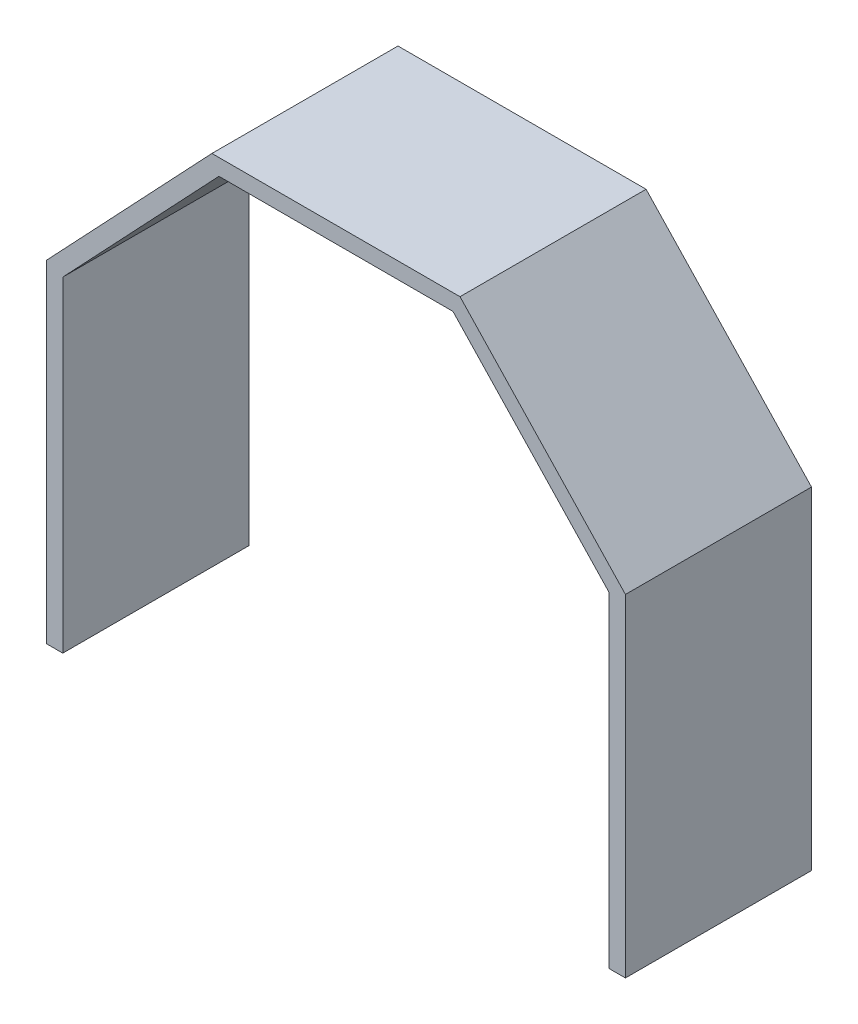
ISO-10303-21;
HEADER;
FILE_DESCRIPTION(('STEP AP214'),'2;1');
FILE_NAME('part.step','',(''),(''),'','','');
FILE_SCHEMA(('AUTOMOTIVE_DESIGN { 1 0 10303 214 1 1 1 1 }'));
ENDSEC;
DATA;
#1=APPLICATION_CONTEXT('core data for automotive mechanical design processes');
#2=APPLICATION_PROTOCOL_DEFINITION('international standard','automotive_design',2000,#1);
#3=PRODUCT_CONTEXT('',#1,'mechanical');
#4=PRODUCT('Part','Part','',(#3));
#5=PRODUCT_RELATED_PRODUCT_CATEGORY('part','',(#4));
#6=PRODUCT_DEFINITION_FORMATION('','',#4);
#7=PRODUCT_DEFINITION_CONTEXT('part definition',#1,'design');
#8=PRODUCT_DEFINITION('design','',#6,#7);
#9=PRODUCT_DEFINITION_SHAPE('','',#8);
#10=(LENGTH_UNIT() NAMED_UNIT(*) SI_UNIT(.MILLI.,.METRE.));
#11=(NAMED_UNIT(*) PLANE_ANGLE_UNIT() SI_UNIT($,.RADIAN.));
#12=(NAMED_UNIT(*) SI_UNIT($,.STERADIAN.) SOLID_ANGLE_UNIT());
#13=UNCERTAINTY_MEASURE_WITH_UNIT(LENGTH_MEASURE(1.E-05),#10,'distance_accuracy_value','');
#14=(GEOMETRIC_REPRESENTATION_CONTEXT(3) GLOBAL_UNCERTAINTY_ASSIGNED_CONTEXT((#13)) GLOBAL_UNIT_ASSIGNED_CONTEXT((#10,
#11,#12)) REPRESENTATION_CONTEXT('',''));
#15=CARTESIAN_POINT('',(0.,0.,0.));
#16=DIRECTION('',(0.,0.,1.));
#17=DIRECTION('',(1.,0.,0.));
#18=AXIS2_PLACEMENT_3D('',#15,#16,#17);
#19=CARTESIAN_POINT('',(35.56,15.24,22.86));
#20=DIRECTION('',(-1.,0.,0.));
#21=DIRECTION('',(0.,0.,1.));
#22=AXIS2_PLACEMENT_3D('',#19,#20,#21);
#23=PLANE('',#22);
#24=DIRECTION('',(0.,1.,0.));
#25=VECTOR('',#24,1.);
#26=CARTESIAN_POINT('',(35.56,15.24,0.));
#27=LINE('',#26,#25);
#28=CARTESIAN_POINT('',(35.56,-25.5651,0.));
#29=VERTEX_POINT('',#28);
#30=CARTESIAN_POINT('',(35.56,15.24,0.));
#31=VERTEX_POINT('',#30);
#32=EDGE_CURVE('E97',#29,#31,#27,.T.);
#33=ORIENTED_EDGE('',*,*,#32,.T.);
#34=DIRECTION('',(0.,0.,-1.));
#35=VECTOR('',#34,1.);
#36=CARTESIAN_POINT('',(35.56,15.24,22.86));
#37=LINE('',#36,#35);
#38=CARTESIAN_POINT('',(35.56,15.24,22.86));
#39=VERTEX_POINT('',#38);
#40=EDGE_CURVE('E11',#39,#31,#37,.T.);
#41=ORIENTED_EDGE('',*,*,#40,.F.);
#42=DIRECTION('',(0.,1.,0.));
#43=VECTOR('',#42,1.);
#44=CARTESIAN_POINT('',(35.56,-15.24,22.86));
#45=LINE('',#44,#43);
#46=CARTESIAN_POINT('',(35.56,-25.5651,22.86));
#47=VERTEX_POINT('',#46);
#48=EDGE_CURVE('E103',#47,#39,#45,.T.);
#49=ORIENTED_EDGE('',*,*,#48,.F.);
#50=DIRECTION('',(0.,0.,-1.));
#51=VECTOR('',#50,1.);
#52=CARTESIAN_POINT('',(35.56,-25.5651,22.86));
#53=LINE('',#52,#51);
#54=EDGE_CURVE('E149',#47,#29,#53,.T.);
#55=ORIENTED_EDGE('',*,*,#54,.T.);
#56=EDGE_LOOP('',(#33,#41,#49,#55));
#57=FACE_BOUND('',#56,.T.);
#58=ADVANCED_FACE('F33',(#57),#23,.F.);
#59=CARTESIAN_POINT('',(15.24,36.7600000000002,22.86));
#60=DIRECTION('',(-0.727088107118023,-0.686544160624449,0.));
#61=DIRECTION('',(0.686544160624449,-0.727088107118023,0.));
#62=AXIS2_PLACEMENT_3D('',#59,#60,#61);
#63=PLANE('',#62);
#64=DIRECTION('',(-0.686544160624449,0.727088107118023,0.));
#65=VECTOR('',#64,1.);
#66=CARTESIAN_POINT('',(15.24,36.7600000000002,0.));
#67=LINE('',#66,#65);
#68=CARTESIAN_POINT('',(15.24,36.7600000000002,0.));
#69=VERTEX_POINT('',#68);
#70=EDGE_CURVE('E154',#31,#69,#67,.T.);
#71=ORIENTED_EDGE('',*,*,#70,.T.);
#72=DIRECTION('',(0.,0.,-1.));
#73=VECTOR('',#72,1.);
#74=CARTESIAN_POINT('',(15.24,36.7600000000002,22.86));
#75=LINE('',#74,#73);
#76=CARTESIAN_POINT('',(15.24,36.7600000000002,22.86));
#77=VERTEX_POINT('',#76);
#78=EDGE_CURVE('E41',#77,#69,#75,.T.);
#79=ORIENTED_EDGE('',*,*,#78,.F.);
#80=DIRECTION('',(-0.686544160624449,0.727088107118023,0.));
#81=VECTOR('',#80,1.);
#82=CARTESIAN_POINT('',(15.24,36.7600000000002,22.86));
#83=LINE('',#82,#81);
#84=EDGE_CURVE('E242',#39,#77,#83,.T.);
#85=ORIENTED_EDGE('',*,*,#84,.F.);
#86=ORIENTED_EDGE('',*,*,#40,.T.);
#87=EDGE_LOOP('',(#71,#79,#85,#86));
#88=FACE_BOUND('',#87,.T.);
#89=ADVANCED_FACE('F245',(#88),#63,.F.);
#90=CARTESIAN_POINT('',(-15.24,36.76,22.86));
#91=DIRECTION('',(0.,-1.,0.));
#92=DIRECTION('',(1.,0.,0.));
#93=AXIS2_PLACEMENT_3D('',#90,#91,#92);
#94=PLANE('',#93);
#95=DIRECTION('',(-1.,0.,0.));
#96=VECTOR('',#95,1.);
#97=CARTESIAN_POINT('',(-15.24,36.76,0.));
#98=LINE('',#97,#96);
#99=CARTESIAN_POINT('',(-15.24,36.76,0.));
#100=VERTEX_POINT('',#99);
#101=EDGE_CURVE('E156',#69,#100,#98,.T.);
#102=ORIENTED_EDGE('',*,*,#101,.T.);
#103=DIRECTION('',(0.,0.,-1.));
#104=VECTOR('',#103,1.);
#105=CARTESIAN_POINT('',(-15.24,36.76,22.86));
#106=LINE('',#105,#104);
#107=CARTESIAN_POINT('',(-15.24,36.76,22.86));
#108=VERTEX_POINT('',#107);
#109=EDGE_CURVE('E195',#108,#100,#106,.T.);
#110=ORIENTED_EDGE('',*,*,#109,.F.);
#111=DIRECTION('',(-1.,0.,0.));
#112=VECTOR('',#111,1.);
#113=CARTESIAN_POINT('',(-15.24,36.76,22.86));
#114=LINE('',#113,#112);
#115=EDGE_CURVE('E204',#77,#108,#114,.T.);
#116=ORIENTED_EDGE('',*,*,#115,.F.);
#117=ORIENTED_EDGE('',*,*,#78,.T.);
#118=EDGE_LOOP('',(#102,#110,#116,#117));
#119=FACE_BOUND('',#118,.T.);
#120=ADVANCED_FACE('F202',(#119),#94,.F.);
#121=CARTESIAN_POINT('',(-35.56,15.24,22.86));
#122=DIRECTION('',(0.727088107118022,-0.68654416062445,0.));
#123=DIRECTION('',(0.686544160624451,0.727088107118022,0.));
#124=AXIS2_PLACEMENT_3D('',#121,#122,#123);
#125=PLANE('',#124);
#126=DIRECTION('',(-0.68654416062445,-0.727088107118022,0.));
#127=VECTOR('',#126,1.);
#128=CARTESIAN_POINT('',(-35.56,15.24,0.));
#129=LINE('',#128,#127);
#130=CARTESIAN_POINT('',(-35.56,15.24,0.));
#131=VERTEX_POINT('',#130);
#132=EDGE_CURVE('E158',#100,#131,#129,.T.);
#133=ORIENTED_EDGE('',*,*,#132,.T.);
#134=DIRECTION('',(0.,0.,-1.));
#135=VECTOR('',#134,1.);
#136=CARTESIAN_POINT('',(-35.56,15.24,22.86));
#137=LINE('',#136,#135);
#138=CARTESIAN_POINT('',(-35.56,15.24,22.86));
#139=VERTEX_POINT('',#138);
#140=EDGE_CURVE('E192',#139,#131,#137,.T.);
#141=ORIENTED_EDGE('',*,*,#140,.F.);
#142=DIRECTION('',(-0.68654416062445,-0.727088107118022,0.));
#143=VECTOR('',#142,1.);
#144=CARTESIAN_POINT('',(-35.56,15.24,22.86));
#145=LINE('',#144,#143);
#146=EDGE_CURVE('E221',#108,#139,#145,.T.);
#147=ORIENTED_EDGE('',*,*,#146,.F.);
#148=ORIENTED_EDGE('',*,*,#109,.T.);
#149=EDGE_LOOP('',(#133,#141,#147,#148));
#150=FACE_BOUND('',#149,.T.);
#151=ADVANCED_FACE('F212',(#150),#125,.F.);
#152=CARTESIAN_POINT('',(-35.56,-15.24,22.86));
#153=DIRECTION('',(1.,0.,0.));
#154=DIRECTION('',(0.,1.,0.));
#155=AXIS2_PLACEMENT_3D('',#152,#153,#154);
#156=PLANE('',#155);
#157=DIRECTION('',(0.,-1.,0.));
#158=VECTOR('',#157,1.);
#159=CARTESIAN_POINT('',(-35.56,-15.24,0.));
#160=LINE('',#159,#158);
#161=CARTESIAN_POINT('',(-35.56,-25.5651,0.));
#162=VERTEX_POINT('',#161);
#163=EDGE_CURVE('E161',#131,#162,#160,.T.);
#164=ORIENTED_EDGE('',*,*,#163,.T.);
#165=DIRECTION('',(0.,0.,-1.));
#166=VECTOR('',#165,1.);
#167=CARTESIAN_POINT('',(-35.56,-25.5651,22.86));
#168=LINE('',#167,#166);
#169=CARTESIAN_POINT('',(-35.56,-25.5651,22.86));
#170=VERTEX_POINT('',#169);
#171=EDGE_CURVE('E189',#170,#162,#168,.T.);
#172=ORIENTED_EDGE('',*,*,#171,.F.);
#173=DIRECTION('',(0.,-1.,0.));
#174=VECTOR('',#173,1.);
#175=CARTESIAN_POINT('',(-35.56,15.24,22.86));
#176=LINE('',#175,#174);
#177=EDGE_CURVE('E218',#139,#170,#176,.T.);
#178=ORIENTED_EDGE('',*,*,#177,.F.);
#179=ORIENTED_EDGE('',*,*,#140,.T.);
#180=EDGE_LOOP('',(#164,#172,#178,#179));
#181=FACE_BOUND('',#180,.T.);
#182=ADVANCED_FACE('F216',(#181),#156,.F.);
#183=CARTESIAN_POINT('',(-35.56,-25.5651,22.86));
#184=DIRECTION('',(0.,1.,0.));
#185=DIRECTION('',(0.,0.,1.));
#186=AXIS2_PLACEMENT_3D('',#183,#184,#185);
#187=PLANE('',#186);
#188=DIRECTION('',(1.,0.,0.));
#189=VECTOR('',#188,1.);
#190=CARTESIAN_POINT('',(-35.56,-25.5651,0.));
#191=LINE('',#190,#189);
#192=CARTESIAN_POINT('',(-33.56,-25.5651,0.));
#193=VERTEX_POINT('',#192);
#194=EDGE_CURVE('E163',#162,#193,#191,.T.);
#195=ORIENTED_EDGE('',*,*,#194,.T.);
#196=DIRECTION('',(0.,0.,-1.));
#197=VECTOR('',#196,1.);
#198=CARTESIAN_POINT('',(-33.56,-25.5651,22.86));
#199=LINE('',#198,#197);
#200=CARTESIAN_POINT('',(-33.56,-25.5651,22.86));
#201=VERTEX_POINT('',#200);
#202=EDGE_CURVE('E186',#201,#193,#199,.T.);
#203=ORIENTED_EDGE('',*,*,#202,.F.);
#204=DIRECTION('',(1.,0.,0.));
#205=VECTOR('',#204,1.);
#206=CARTESIAN_POINT('',(-35.56,-25.5651,22.86));
#207=LINE('',#206,#205);
#208=EDGE_CURVE('E220',#170,#201,#207,.T.);
#209=ORIENTED_EDGE('',*,*,#208,.F.);
#210=ORIENTED_EDGE('',*,*,#171,.T.);
#211=EDGE_LOOP('',(#195,#203,#209,#210));
#212=FACE_BOUND('',#211,.T.);
#213=ADVANCED_FACE('F257',(#212),#187,.F.);
#214=CARTESIAN_POINT('',(-33.56,-25.5651,22.86));
#215=DIRECTION('',(-1.,0.,0.));
#216=DIRECTION('',(0.,-1.,0.));
#217=AXIS2_PLACEMENT_3D('',#214,#215,#216);
#218=PLANE('',#217);
#219=DIRECTION('',(0.,1.,0.));
#220=VECTOR('',#219,1.);
#221=CARTESIAN_POINT('',(-33.56,-25.5651,0.));
#222=LINE('',#221,#220);
#223=CARTESIAN_POINT('',(-33.56,14.4449691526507,0.));
#224=VERTEX_POINT('',#223);
#225=EDGE_CURVE('E165',#193,#224,#222,.T.);
#226=ORIENTED_EDGE('',*,*,#225,.T.);
#227=DIRECTION('',(0.,0.,-1.));
#228=VECTOR('',#227,1.);
#229=CARTESIAN_POINT('',(-33.56,14.4449691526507,22.86));
#230=LINE('',#229,#228);
#231=CARTESIAN_POINT('',(-33.56,14.4449691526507,22.86));
#232=VERTEX_POINT('',#231);
#233=EDGE_CURVE('E183',#232,#224,#230,.T.);
#234=ORIENTED_EDGE('',*,*,#233,.F.);
#235=DIRECTION('',(0.,1.,0.));
#236=VECTOR('',#235,1.);
#237=CARTESIAN_POINT('',(-33.56,-25.5651,22.86));
#238=LINE('',#237,#236);
#239=EDGE_CURVE('E223',#201,#232,#238,.T.);
#240=ORIENTED_EDGE('',*,*,#239,.F.);
#241=ORIENTED_EDGE('',*,*,#202,.T.);
#242=EDGE_LOOP('',(#226,#234,#240,#241));
#243=FACE_BOUND('',#242,.T.);
#244=ADVANCED_FACE('F260',(#243),#218,.F.);
#245=CARTESIAN_POINT('',(-33.56,14.4449691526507,22.86));
#246=DIRECTION('',(-0.727088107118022,0.686544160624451,0.));
#247=DIRECTION('',(-0.686544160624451,-0.727088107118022,0.));
#248=AXIS2_PLACEMENT_3D('',#245,#246,#247);
#249=PLANE('',#248);
#250=DIRECTION('',(0.686544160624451,0.727088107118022,0.));
#251=VECTOR('',#250,1.);
#252=CARTESIAN_POINT('',(-33.56,14.4449691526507,0.));
#253=LINE('',#252,#251);
#254=CARTESIAN_POINT('',(-14.377777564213,34.76,0.));
#255=VERTEX_POINT('',#254);
#256=EDGE_CURVE('E167',#224,#255,#253,.T.);
#257=ORIENTED_EDGE('',*,*,#256,.T.);
#258=DIRECTION('',(0.,0.,-1.));
#259=VECTOR('',#258,1.);
#260=CARTESIAN_POINT('',(-14.377777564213,34.76,22.86));
#261=LINE('',#260,#259);
#262=CARTESIAN_POINT('',(-14.377777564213,34.76,22.86));
#263=VERTEX_POINT('',#262);
#264=EDGE_CURVE('E180',#263,#255,#261,.T.);
#265=ORIENTED_EDGE('',*,*,#264,.F.);
#266=DIRECTION('',(0.686544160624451,0.727088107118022,0.));
#267=VECTOR('',#266,1.);
#268=CARTESIAN_POINT('',(-33.56,14.4449691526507,22.86));
#269=LINE('',#268,#267);
#270=EDGE_CURVE('E229',#232,#263,#269,.T.);
#271=ORIENTED_EDGE('',*,*,#270,.F.);
#272=ORIENTED_EDGE('',*,*,#233,.T.);
#273=EDGE_LOOP('',(#257,#265,#271,#272));
#274=FACE_BOUND('',#273,.T.);
#275=ADVANCED_FACE('F235',(#274),#249,.F.);
#276=CARTESIAN_POINT('',(14.377777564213,34.76,22.86));
#277=DIRECTION('',(0.,1.,0.));
#278=DIRECTION('',(-1.,0.,0.));
#279=AXIS2_PLACEMENT_3D('',#276,#277,#278);
#280=PLANE('',#279);
#281=DIRECTION('',(1.,0.,0.));
#282=VECTOR('',#281,1.);
#283=CARTESIAN_POINT('',(14.377777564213,34.76,0.));
#284=LINE('',#283,#282);
#285=CARTESIAN_POINT('',(14.377777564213,34.76,0.));
#286=VERTEX_POINT('',#285);
#287=EDGE_CURVE('E170',#255,#286,#284,.T.);
#288=ORIENTED_EDGE('',*,*,#287,.T.);
#289=DIRECTION('',(0.,0.,-1.));
#290=VECTOR('',#289,1.);
#291=CARTESIAN_POINT('',(14.377777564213,34.76,22.86));
#292=LINE('',#291,#290);
#293=CARTESIAN_POINT('',(14.377777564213,34.76,22.86));
#294=VERTEX_POINT('',#293);
#295=EDGE_CURVE('E144',#294,#286,#292,.T.);
#296=ORIENTED_EDGE('',*,*,#295,.F.);
#297=DIRECTION('',(1.,0.,0.));
#298=VECTOR('',#297,1.);
#299=CARTESIAN_POINT('',(-14.377777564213,34.76,22.86));
#300=LINE('',#299,#298);
#301=EDGE_CURVE('E135',#263,#294,#300,.T.);
#302=ORIENTED_EDGE('',*,*,#301,.F.);
#303=ORIENTED_EDGE('',*,*,#264,.T.);
#304=EDGE_LOOP('',(#288,#296,#302,#303));
#305=FACE_BOUND('',#304,.T.);
#306=ADVANCED_FACE('F238',(#305),#280,.F.);
#307=CARTESIAN_POINT('',(33.56,14.4449691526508,22.86));
#308=DIRECTION('',(0.727088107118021,0.686544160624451,0.));
#309=DIRECTION('',(-0.686544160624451,0.727088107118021,0.));
#310=AXIS2_PLACEMENT_3D('',#307,#308,#309);
#311=PLANE('',#310);
#312=DIRECTION('',(0.686544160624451,-0.727088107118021,0.));
#313=VECTOR('',#312,1.);
#314=CARTESIAN_POINT('',(33.56,14.4449691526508,0.));
#315=LINE('',#314,#313);
#316=CARTESIAN_POINT('',(33.56,14.4449691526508,0.));
#317=VERTEX_POINT('',#316);
#318=EDGE_CURVE('E143',#286,#317,#315,.T.);
#319=ORIENTED_EDGE('',*,*,#318,.T.);
#320=DIRECTION('',(0.,0.,-1.));
#321=VECTOR('',#320,1.);
#322=CARTESIAN_POINT('',(33.56,14.4449691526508,22.86));
#323=LINE('',#322,#321);
#324=CARTESIAN_POINT('',(33.56,14.4449691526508,22.86));
#325=VERTEX_POINT('',#324);
#326=EDGE_CURVE('E140',#325,#317,#323,.T.);
#327=ORIENTED_EDGE('',*,*,#326,.F.);
#328=DIRECTION('',(0.686544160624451,-0.727088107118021,0.));
#329=VECTOR('',#328,1.);
#330=CARTESIAN_POINT('',(33.56,14.4449691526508,22.86));
#331=LINE('',#330,#329);
#332=EDGE_CURVE('E129',#294,#325,#331,.T.);
#333=ORIENTED_EDGE('',*,*,#332,.F.);
#334=ORIENTED_EDGE('',*,*,#295,.T.);
#335=EDGE_LOOP('',(#319,#327,#333,#334));
#336=FACE_BOUND('',#335,.T.);
#337=ADVANCED_FACE('F141',(#336),#311,.F.);
#338=CARTESIAN_POINT('',(33.56,-25.5651,22.86));
#339=DIRECTION('',(1.,0.,0.));
#340=DIRECTION('',(0.,1.,0.));
#341=AXIS2_PLACEMENT_3D('',#338,#339,#340);
#342=PLANE('',#341);
#343=DIRECTION('',(0.,-1.,0.));
#344=VECTOR('',#343,1.);
#345=CARTESIAN_POINT('',(33.56,-25.5651,0.));
#346=LINE('',#345,#344);
#347=CARTESIAN_POINT('',(33.56,-25.5651,0.));
#348=VERTEX_POINT('',#347);
#349=EDGE_CURVE('E90',#317,#348,#346,.T.);
#350=ORIENTED_EDGE('',*,*,#349,.T.);
#351=DIRECTION('',(0.,0.,-1.));
#352=VECTOR('',#351,1.);
#353=CARTESIAN_POINT('',(33.56,-25.5651,22.86));
#354=LINE('',#353,#352);
#355=CARTESIAN_POINT('',(33.56,-25.5651,22.86));
#356=VERTEX_POINT('',#355);
#357=EDGE_CURVE('E145',#356,#348,#354,.T.);
#358=ORIENTED_EDGE('',*,*,#357,.F.);
#359=DIRECTION('',(0.,-1.,0.));
#360=VECTOR('',#359,1.);
#361=CARTESIAN_POINT('',(33.56,-25.5651,22.86));
#362=LINE('',#361,#360);
#363=EDGE_CURVE('E133',#325,#356,#362,.T.);
#364=ORIENTED_EDGE('',*,*,#363,.F.);
#365=ORIENTED_EDGE('',*,*,#326,.T.);
#366=EDGE_LOOP('',(#350,#358,#364,#365));
#367=FACE_BOUND('',#366,.T.);
#368=ADVANCED_FACE('F147',(#367),#342,.F.);
#369=CARTESIAN_POINT('',(33.56,-25.5651,22.86));
#370=DIRECTION('',(0.,1.,0.));
#371=DIRECTION('',(-1.,0.,0.));
#372=AXIS2_PLACEMENT_3D('',#369,#370,#371);
#373=PLANE('',#372);
#374=DIRECTION('',(1.,0.,0.));
#375=VECTOR('',#374,1.);
#376=CARTESIAN_POINT('',(33.56,-25.5651,0.));
#377=LINE('',#376,#375);
#378=EDGE_CURVE('E174',#348,#29,#377,.T.);
#379=ORIENTED_EDGE('',*,*,#378,.T.);
#380=ORIENTED_EDGE('',*,*,#54,.F.);
#381=DIRECTION('',(1.,0.,0.));
#382=VECTOR('',#381,1.);
#383=CARTESIAN_POINT('',(33.56,-25.5651,22.86));
#384=LINE('',#383,#382);
#385=EDGE_CURVE('E49',#356,#47,#384,.T.);
#386=ORIENTED_EDGE('',*,*,#385,.F.);
#387=ORIENTED_EDGE('',*,*,#357,.T.);
#388=EDGE_LOOP('',(#379,#380,#386,#387));
#389=FACE_BOUND('',#388,.T.);
#390=ADVANCED_FACE('F240',(#389),#373,.F.);
#391=CARTESIAN_POINT('',(0.,0.,22.86));
#392=DIRECTION('',(0.,0.,1.));
#393=DIRECTION('',(1.,0.,0.));
#394=AXIS2_PLACEMENT_3D('',#391,#392,#393);
#395=PLANE('',#394);
#396=ORIENTED_EDGE('',*,*,#48,.T.);
#397=ORIENTED_EDGE('',*,*,#84,.T.);
#398=ORIENTED_EDGE('',*,*,#115,.T.);
#399=ORIENTED_EDGE('',*,*,#146,.T.);
#400=ORIENTED_EDGE('',*,*,#177,.T.);
#401=ORIENTED_EDGE('',*,*,#208,.T.);
#402=ORIENTED_EDGE('',*,*,#239,.T.);
#403=ORIENTED_EDGE('',*,*,#270,.T.);
#404=ORIENTED_EDGE('',*,*,#301,.T.);
#405=ORIENTED_EDGE('',*,*,#332,.T.);
#406=ORIENTED_EDGE('',*,*,#363,.T.);
#407=ORIENTED_EDGE('',*,*,#385,.T.);
#408=EDGE_LOOP('',(#396,#397,#398,#399,#400,#401,#402,#403,#404,#405,#406,#407));
#409=FACE_BOUND('',#408,.T.);
#410=ADVANCED_FACE('F131',(#409),#395,.T.);
#411=CARTESIAN_POINT('',(0.,0.,0.));
#412=DIRECTION('',(0.,0.,1.));
#413=DIRECTION('',(1.,0.,0.));
#414=AXIS2_PLACEMENT_3D('',#411,#412,#413);
#415=PLANE('',#414);
#416=ORIENTED_EDGE('',*,*,#32,.F.);
#417=ORIENTED_EDGE('',*,*,#378,.F.);
#418=ORIENTED_EDGE('',*,*,#349,.F.);
#419=ORIENTED_EDGE('',*,*,#318,.F.);
#420=ORIENTED_EDGE('',*,*,#287,.F.);
#421=ORIENTED_EDGE('',*,*,#256,.F.);
#422=ORIENTED_EDGE('',*,*,#225,.F.);
#423=ORIENTED_EDGE('',*,*,#194,.F.);
#424=ORIENTED_EDGE('',*,*,#163,.F.);
#425=ORIENTED_EDGE('',*,*,#132,.F.);
#426=ORIENTED_EDGE('',*,*,#101,.F.);
#427=ORIENTED_EDGE('',*,*,#70,.F.);
#428=EDGE_LOOP('',(#416,#417,#418,#419,#420,#421,#422,#423,#424,#425,#426,#427));
#429=FACE_BOUND('',#428,.T.);
#430=ADVANCED_FACE('F208',(#429),#415,.F.);
#431=CLOSED_SHELL('',(#58,#89,#120,#151,#182,#213,#244,#275,#306,#337,#368,#390,#410,#430));
#432=MANIFOLD_SOLID_BREP('B2',#431);
#433=ADVANCED_BREP_SHAPE_REPRESENTATION('',(#18,#432),#14);
#434=SHAPE_DEFINITION_REPRESENTATION(#9,#433);
ENDSEC;
END-ISO-10303-21;
